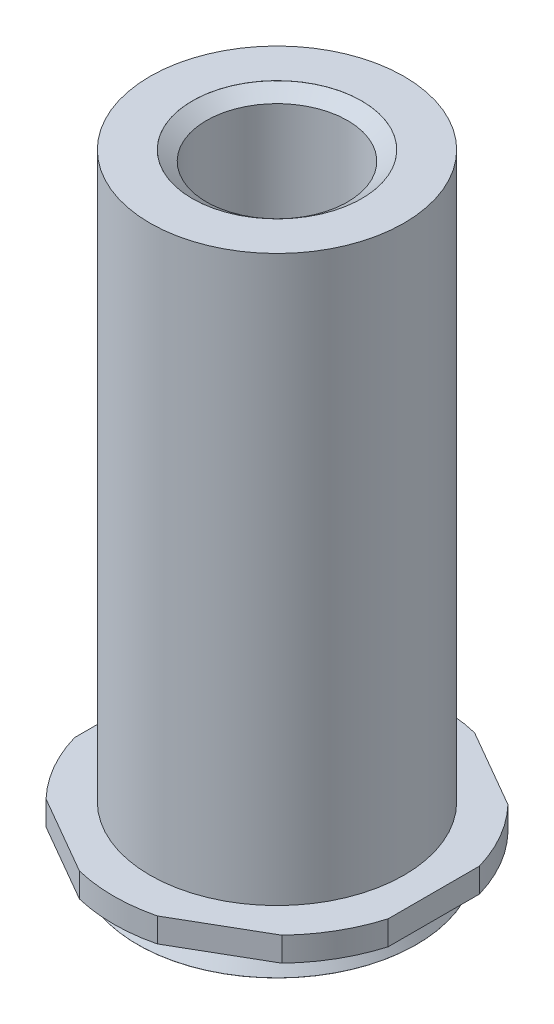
from build123d import *

# Parameters (mm, degrees)
HEXDIESKE_R  = 6.4443
HEXDIE_DEPTH = 0.8595


with BuildPart() as part:
    # BodySke → Body (revolve)
    with BuildSketch(Plane.XY, mode=Mode.PRIVATE) as body_sk:
        Polygon((4.500636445, 0), (5.785104, 0), (5.785104, 0.8595), (4.5, 0.8595), (4.5, 20.8595), (2.5, 20.8595), (2.5, 11.2595), (0, 11.2595), (0, -1.0505), (4.94, -1.0505), (4.94, -1.0475), (4.500636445, -0.2865), align=None)
    revolve(body_sk.sketch.rotate(Axis((0, 0, 0), (0, 1, 0)), 90), axis=Axis((0, 0, 0), (0, 1, 0)))

    # TapDriSke → TapDrill (revolve, cut)
    with BuildSketch(Plane.XY, mode=Mode.PRIVATE) as tapdrill_sk:
        Polygon((2.5, 6.2595), (2.5, 20.8595), (0, 20.8595), (0, 5.223966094), align=None)
    revolve(tapdrill_sk.sketch.rotate(Axis((0, 0, 0), (0, 1, 0)), 90), axis=Axis((0, 0, 0), (0, 1, 0)), mode=Mode.SUBTRACT)

    # EndChamferSke → EndChamfer (revolve, cut)
    with BuildSketch(Plane.XY, mode=Mode.PRIVATE) as endchamfer_sk:
        Polygon((3, 20.85696), (2.5, 20.506986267), (2.5, 21.1135), (3, 21.1135), align=None)
    revolve(endchamfer_sk.sketch.rotate(Axis((0, -2.54, 0), (0, 1, 0)), 90), axis=Axis((0, -2.54, 0), (0, 1, 0)), mode=Mode.SUBTRACT)

    # HexDieSke → HexDie (cut)
    with BuildSketch(Plane(origin=(0, 0.8595, 0), x_dir=(-1, 0, 0), z_dir=(0, 1, 0))):
        Circle(HEXDIESKE_R)
        Polygon((0, 6.414361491), (5.555, 3.207180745), (5.555, -3.207180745), (0, -6.414361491), (-5.555, -3.207180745), (-5.555, 3.207180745), align=None, mode=Mode.SUBTRACT)
    extrude(amount=-HEXDIE_DEPTH, mode=Mode.SUBTRACT)


solid = part.part
